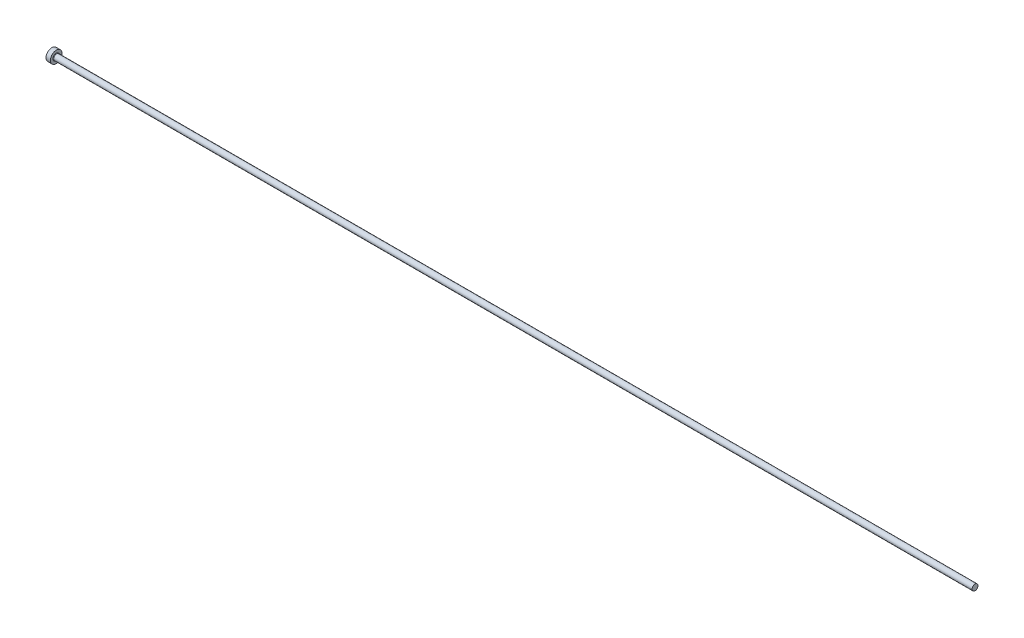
ISO-10303-21;
HEADER;
FILE_DESCRIPTION(('STEP AP214'),'2;1');
FILE_NAME('part.step','',(''),(''),'','','');
FILE_SCHEMA(('AUTOMOTIVE_DESIGN { 1 0 10303 214 1 1 1 1 }'));
ENDSEC;
DATA;
#1=APPLICATION_CONTEXT('core data for automotive mechanical design processes');
#2=APPLICATION_PROTOCOL_DEFINITION('international standard','automotive_design',2000,#1);
#3=PRODUCT_CONTEXT('',#1,'mechanical');
#4=PRODUCT('Part','Part','',(#3));
#5=PRODUCT_RELATED_PRODUCT_CATEGORY('part','',(#4));
#6=PRODUCT_DEFINITION_FORMATION('','',#4);
#7=PRODUCT_DEFINITION_CONTEXT('part definition',#1,'design');
#8=PRODUCT_DEFINITION('design','',#6,#7);
#9=PRODUCT_DEFINITION_SHAPE('','',#8);
#10=(LENGTH_UNIT() NAMED_UNIT(*) SI_UNIT(.MILLI.,.METRE.));
#11=(NAMED_UNIT(*) PLANE_ANGLE_UNIT() SI_UNIT($,.RADIAN.));
#12=(NAMED_UNIT(*) SI_UNIT($,.STERADIAN.) SOLID_ANGLE_UNIT());
#13=UNCERTAINTY_MEASURE_WITH_UNIT(LENGTH_MEASURE(1.E-05),#10,'distance_accuracy_value','');
#14=(GEOMETRIC_REPRESENTATION_CONTEXT(3) GLOBAL_UNCERTAINTY_ASSIGNED_CONTEXT((#13)) GLOBAL_UNIT_ASSIGNED_CONTEXT((#10,
#11,#12)) REPRESENTATION_CONTEXT('',''));
#15=CARTESIAN_POINT('',(0.,0.,0.));
#16=DIRECTION('',(0.,0.,1.));
#17=DIRECTION('',(1.,0.,0.));
#18=AXIS2_PLACEMENT_3D('',#15,#16,#17);
#19=CARTESIAN_POINT('',(0.,0.,0.));
#20=DIRECTION('',(-1.,0.,0.));
#21=DIRECTION('',(0.,-1.,0.));
#22=AXIS2_PLACEMENT_3D('',#19,#20,#21);
#23=PLANE('',#22);
#24=CARTESIAN_POINT('',(0.,0.,0.));
#25=DIRECTION('',(1.,0.,0.));
#26=DIRECTION('',(0.,1.,0.));
#27=AXIS2_PLACEMENT_3D('',#24,#25,#26);
#28=CIRCLE('',#27,4.);
#29=CARTESIAN_POINT('',(0.,4.,0.));
#30=VERTEX_POINT('',#29);
#31=EDGE_CURVE('E25',#30,#30,#28,.T.);
#32=ORIENTED_EDGE('',*,*,#31,.F.);
#33=EDGE_LOOP('',(#32));
#34=FACE_BOUND('',#33,.T.);
#35=ADVANCED_FACE('F14',(#34),#23,.T.);
#36=CARTESIAN_POINT('',(630.,0.,0.));
#37=DIRECTION('',(1.,0.,0.));
#38=DIRECTION('',(0.,1.,0.));
#39=AXIS2_PLACEMENT_3D('',#36,#37,#38);
#40=CYLINDRICAL_SURFACE('',#39,4.);
#41=ORIENTED_EDGE('',*,*,#31,.T.);
#42=EDGE_LOOP('',(#41));
#43=FACE_BOUND('',#42,.T.);
#44=CARTESIAN_POINT('',(3.,0.,0.));
#45=DIRECTION('',(1.,0.,0.));
#46=DIRECTION('',(0.,1.,0.));
#47=AXIS2_PLACEMENT_3D('',#44,#45,#46);
#48=CIRCLE('',#47,4.);
#49=CARTESIAN_POINT('',(3.,4.,0.));
#50=VERTEX_POINT('',#49);
#51=EDGE_CURVE('E29',#50,#50,#48,.T.);
#52=ORIENTED_EDGE('',*,*,#51,.F.);
#53=EDGE_LOOP('',(#52));
#54=FACE_BOUND('',#53,.T.);
#55=ADVANCED_FACE('F51',(#43,#54),#40,.T.);
#56=CARTESIAN_POINT('',(3.,4.,0.));
#57=DIRECTION('',(1.,0.,0.));
#58=DIRECTION('',(0.,1.,0.));
#59=AXIS2_PLACEMENT_3D('',#56,#57,#58);
#60=PLANE('',#59);
#61=CARTESIAN_POINT('',(3.,0.,0.));
#62=DIRECTION('',(1.,0.,0.));
#63=DIRECTION('',(0.,1.,0.));
#64=AXIS2_PLACEMENT_3D('',#61,#62,#63);
#65=CIRCLE('',#64,2.29999999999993);
#66=CARTESIAN_POINT('',(3.,2.29999999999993,0.));
#67=VERTEX_POINT('',#66);
#68=EDGE_CURVE('E9',#67,#67,#65,.F.);
#69=ORIENTED_EDGE('',*,*,#68,.T.);
#70=EDGE_LOOP('',(#69));
#71=FACE_BOUND('',#70,.T.);
#72=ORIENTED_EDGE('',*,*,#51,.T.);
#73=EDGE_LOOP('',(#72));
#74=FACE_BOUND('',#73,.T.);
#75=ADVANCED_FACE('F42',(#71,#74),#60,.T.);
#76=CARTESIAN_POINT('',(630.,0.,0.));
#77=DIRECTION('',(1.,0.,0.));
#78=DIRECTION('',(0.,1.,0.));
#79=AXIS2_PLACEMENT_3D('',#76,#77,#78);
#80=CYLINDRICAL_SURFACE('',#79,1.99999999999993);
#81=CARTESIAN_POINT('',(3.3,0.,0.));
#82=DIRECTION('',(1.,0.,0.));
#83=DIRECTION('',(0.,1.,0.));
#84=AXIS2_PLACEMENT_3D('',#81,#82,#83);
#85=CIRCLE('',#84,1.99999999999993);
#86=CARTESIAN_POINT('',(3.3,1.99999999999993,0.));
#87=VERTEX_POINT('',#86);
#88=EDGE_CURVE('E21',#87,#87,#85,.T.);
#89=ORIENTED_EDGE('',*,*,#88,.T.);
#90=EDGE_LOOP('',(#89));
#91=FACE_BOUND('',#90,.T.);
#92=CARTESIAN_POINT('',(630.,0.,0.));
#93=DIRECTION('',(1.,0.,0.));
#94=DIRECTION('',(0.,1.,0.));
#95=AXIS2_PLACEMENT_3D('',#92,#93,#94);
#96=CIRCLE('',#95,1.99999999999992);
#97=CARTESIAN_POINT('',(630.,1.99999999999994,0.));
#98=VERTEX_POINT('',#97);
#99=EDGE_CURVE('E34',#98,#98,#96,.T.);
#100=ORIENTED_EDGE('',*,*,#99,.F.);
#101=EDGE_LOOP('',(#100));
#102=FACE_BOUND('',#101,.T.);
#103=ADVANCED_FACE('F40',(#91,#102),#80,.T.);
#104=CARTESIAN_POINT('',(630.,1.99999999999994,0.));
#105=DIRECTION('',(1.,0.,0.));
#106=DIRECTION('',(0.,1.,0.));
#107=AXIS2_PLACEMENT_3D('',#104,#105,#106);
#108=PLANE('',#107);
#109=ORIENTED_EDGE('',*,*,#99,.T.);
#110=EDGE_LOOP('',(#109));
#111=FACE_BOUND('',#110,.T.);
#112=ADVANCED_FACE('F38',(#111),#108,.T.);
#113=CARTESIAN_POINT('',(3.3,0.,0.));
#114=DIRECTION('',(1.,0.,0.));
#115=DIRECTION('',(0.,1.,0.));
#116=AXIS2_PLACEMENT_3D('',#113,#114,#115);
#117=TOROIDAL_SURFACE('',#116,2.29999999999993,0.3);
#118=ORIENTED_EDGE('',*,*,#68,.F.);
#119=EDGE_LOOP('',(#118));
#120=FACE_BOUND('',#119,.T.);
#121=ORIENTED_EDGE('',*,*,#88,.F.);
#122=EDGE_LOOP('',(#121));
#123=FACE_BOUND('',#122,.T.);
#124=ADVANCED_FACE('F16',(#120,#123),#117,.F.);
#125=CLOSED_SHELL('',(#35,#55,#75,#103,#112,#124));
#126=MANIFOLD_SOLID_BREP('B1',#125);
#127=ADVANCED_BREP_SHAPE_REPRESENTATION('',(#18,#126),#14);
#128=SHAPE_DEFINITION_REPRESENTATION(#9,#127);
ENDSEC;
END-ISO-10303-21;
